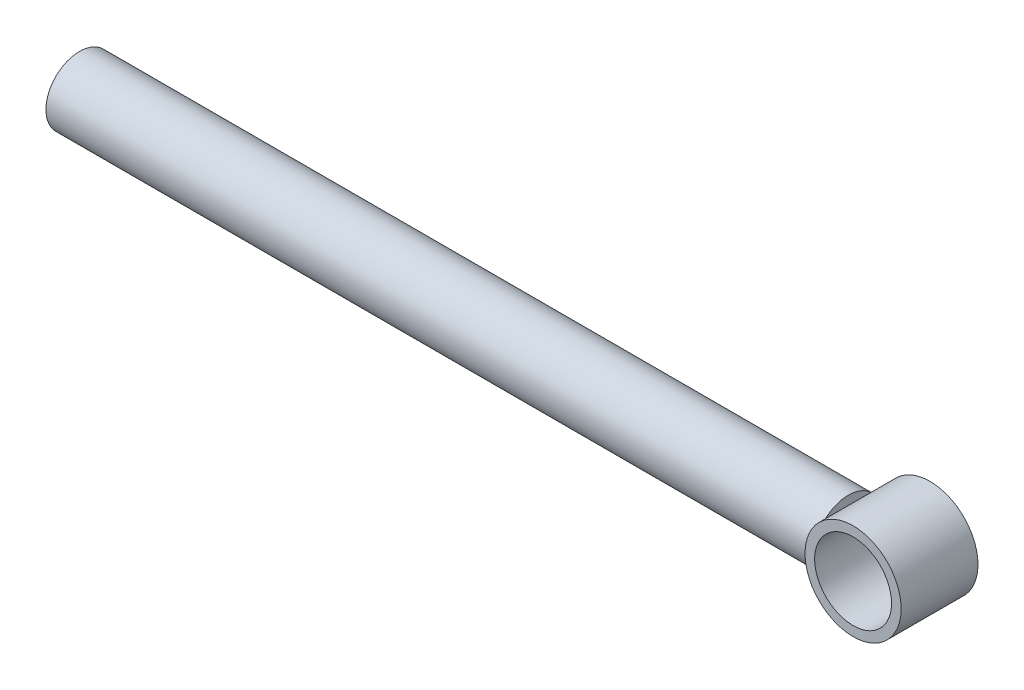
ISO-10303-21;
HEADER;
FILE_DESCRIPTION(('STEP AP214'),'2;1');
FILE_NAME('part.step','',(''),(''),'','','');
FILE_SCHEMA(('AUTOMOTIVE_DESIGN { 1 0 10303 214 1 1 1 1 }'));
ENDSEC;
DATA;
#1=APPLICATION_CONTEXT('core data for automotive mechanical design processes');
#2=APPLICATION_PROTOCOL_DEFINITION('international standard','automotive_design',2000,#1);
#3=PRODUCT_CONTEXT('',#1,'mechanical');
#4=PRODUCT('Part','Part','',(#3));
#5=PRODUCT_RELATED_PRODUCT_CATEGORY('part','',(#4));
#6=PRODUCT_DEFINITION_FORMATION('','',#4);
#7=PRODUCT_DEFINITION_CONTEXT('part definition',#1,'design');
#8=PRODUCT_DEFINITION('design','',#6,#7);
#9=PRODUCT_DEFINITION_SHAPE('','',#8);
#10=(LENGTH_UNIT() NAMED_UNIT(*) SI_UNIT(.MILLI.,.METRE.));
#11=(NAMED_UNIT(*) PLANE_ANGLE_UNIT() SI_UNIT($,.RADIAN.));
#12=(NAMED_UNIT(*) SI_UNIT($,.STERADIAN.) SOLID_ANGLE_UNIT());
#13=UNCERTAINTY_MEASURE_WITH_UNIT(LENGTH_MEASURE(1.E-05),#10,'distance_accuracy_value','');
#14=(GEOMETRIC_REPRESENTATION_CONTEXT(3) GLOBAL_UNCERTAINTY_ASSIGNED_CONTEXT((#13)) GLOBAL_UNIT_ASSIGNED_CONTEXT((#10,
#11,#12)) REPRESENTATION_CONTEXT('',''));
#15=CARTESIAN_POINT('',(0.,0.,0.));
#16=DIRECTION('',(0.,0.,1.));
#17=DIRECTION('',(1.,0.,0.));
#18=AXIS2_PLACEMENT_3D('',#15,#16,#17);
#19=CARTESIAN_POINT('',(0.,0.,50.8));
#20=DIRECTION('',(0.,0.,1.));
#21=DIRECTION('',(1.,0.,0.));
#22=AXIS2_PLACEMENT_3D('',#19,#20,#21);
#23=PLANE('',#22);
#24=CARTESIAN_POINT('',(0.,0.,50.8));
#25=DIRECTION('',(0.,0.,1.));
#26=DIRECTION('',(1.,0.,0.));
#27=AXIS2_PLACEMENT_3D('',#24,#25,#26);
#28=CIRCLE('',#27,63.5);
#29=CARTESIAN_POINT('',(63.5,0.,50.8));
#30=VERTEX_POINT('',#29);
#31=EDGE_CURVE('E381',#30,#30,#28,.T.);
#32=ORIENTED_EDGE('',*,*,#31,.T.);
#33=EDGE_LOOP('',(#32));
#34=FACE_BOUND('',#33,.T.);
#35=CARTESIAN_POINT('',(0.,0.,50.8));
#36=DIRECTION('',(0.,0.,1.));
#37=DIRECTION('',(1.,0.,0.));
#38=AXIS2_PLACEMENT_3D('',#35,#36,#37);
#39=CIRCLE('',#38,50.8);
#40=CARTESIAN_POINT('',(50.8,0.,50.8));
#41=VERTEX_POINT('',#40);
#42=EDGE_CURVE('E422',#41,#41,#39,.T.);
#43=ORIENTED_EDGE('',*,*,#42,.F.);
#44=EDGE_LOOP('',(#43));
#45=FACE_BOUND('',#44,.T.);
#46=ADVANCED_FACE('F348',(#34,#45),#23,.T.);
#47=CARTESIAN_POINT('',(0.,0.,50.8));
#48=DIRECTION('',(0.,0.,-1.));
#49=DIRECTION('',(-1.,0.,0.));
#50=AXIS2_PLACEMENT_3D('',#47,#48,#49);
#51=CYLINDRICAL_SURFACE('',#50,63.5);
#52=CARTESIAN_POINT('',(-57.15,27.6790082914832,34.7803824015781));
#53=CARTESIAN_POINT('',(-57.3608962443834,27.2435633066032,35.1269111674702));
#54=CARTESIAN_POINT('',(-57.5691546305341,26.8008738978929,35.4658636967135));
#55=CARTESIAN_POINT('',(-57.9795220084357,25.9011500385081,36.1281770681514));
#56=CARTESIAN_POINT('',(-58.1816304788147,25.4441143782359,36.4515365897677));
#57=CARTESIAN_POINT('',(-58.7776050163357,24.0512606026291,37.397858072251));
#58=CARTESIAN_POINT('',(-59.1608656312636,23.0942173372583,37.9966470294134));
#59=CARTESIAN_POINT('',(-59.8938910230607,21.1207683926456,39.1282198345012));
#60=CARTESIAN_POINT('',(-60.2434302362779,20.1040275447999,39.6605653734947));
#61=CARTESIAN_POINT('',(-60.8989795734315,18.0209845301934,40.649418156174));
#62=CARTESIAN_POINT('',(-61.2050000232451,16.9546942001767,41.1059433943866));
#63=CARTESIAN_POINT('',(-61.7682326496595,14.7720150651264,41.9399834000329));
#64=CARTESIAN_POINT('',(-62.0251710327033,13.6553858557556,42.3170560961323));
#65=CARTESIAN_POINT('',(-62.4818378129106,11.384677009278,42.9836194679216));
#66=CARTESIAN_POINT('',(-62.6815623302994,10.2305948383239,43.2731042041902));
#67=CARTESIAN_POINT('',(-63.0179242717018,7.89781057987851,43.7589067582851));
#68=CARTESIAN_POINT('',(-63.1547614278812,6.7191990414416,43.9555195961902));
#69=CARTESIAN_POINT('',(-63.3624283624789,4.34428538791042,44.2533762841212));
#70=CARTESIAN_POINT('',(-63.4332671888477,3.14798572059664,44.354633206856));
#71=CARTESIAN_POINT('',(-63.5030389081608,0.875702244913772,44.4543520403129));
#72=CARTESIAN_POINT('',(-63.5087686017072,-0.199661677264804,44.4625306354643));
#73=CARTESIAN_POINT('',(-63.4656951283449,-2.34701468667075,44.4009851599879));
#74=CARTESIAN_POINT('',(-63.416895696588,-3.41900400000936,44.3312664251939));
#75=CARTESIAN_POINT('',(-63.2658562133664,-5.55208119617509,44.114929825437));
#76=CARTESIAN_POINT('',(-63.163580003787,-6.61316120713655,43.9682599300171));
#77=CARTESIAN_POINT('',(-62.9078997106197,-8.71596148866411,43.6001590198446));
#78=CARTESIAN_POINT('',(-62.7544958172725,-9.75768183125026,43.3787282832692));
#79=CARTESIAN_POINT('',(-62.4062122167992,-11.7783000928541,42.873302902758));
#80=CARTESIAN_POINT('',(-62.2129990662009,-12.7581152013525,42.5918095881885));
#81=CARTESIAN_POINT('',(-61.785815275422,-14.6880874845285,41.965366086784));
#82=CARTESIAN_POINT('',(-61.5518436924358,-15.6382439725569,41.6204144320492));
#83=CARTESIAN_POINT('',(-61.0473051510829,-17.5046089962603,40.8705626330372));
#84=CARTESIAN_POINT('',(-60.7767336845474,-18.4208133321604,40.4656551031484));
#85=CARTESIAN_POINT('',(-60.2035377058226,-20.2156194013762,39.599543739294));
#86=CARTESIAN_POINT('',(-59.9009185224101,-21.0942273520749,39.1383492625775));
#87=CARTESIAN_POINT('',(-59.3978527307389,-22.4596823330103,38.362812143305));
#88=CARTESIAN_POINT('',(-59.2062854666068,-22.9596828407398,38.0656282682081));
#89=CARTESIAN_POINT('',(-58.8146170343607,-23.9451844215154,37.4535310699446));
#90=CARTESIAN_POINT('',(-58.6145172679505,-24.4306878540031,37.138620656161));
#91=CARTESIAN_POINT('',(-58.2073867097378,-25.3854014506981,36.4926719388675));
#92=CARTESIAN_POINT('',(-58.000379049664,-25.8546570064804,36.1616860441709));
#93=CARTESIAN_POINT('',(-57.5798335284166,-26.7781698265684,35.4832407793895));
#94=CARTESIAN_POINT('',(-57.3662950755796,-27.2324257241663,35.1357799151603));
#95=CARTESIAN_POINT('',(-57.15,-27.6790082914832,34.7803824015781));
#96=B_SPLINE_CURVE_WITH_KNOTS('',3,(#52,#53,#54,#55,#56,#57,#58,#59,#60,#61,#62,#63,#64,#65,#66,
#67,#68,#69,#70,#71,#72,#73,#74,#75,#76,#77,#78,#79,#80,#81,#82,#83,#84,#85,#86,#87,#88,#89,#90,
#91,#92,#93,#94,#95),.UNSPECIFIED.,.F.,.F.,(4,2,2,2,2,2,2,2,2,2,2,2,2,2,2,2,2,2,2,2,2,4),(0.,
1.78517101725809,3.57049295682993,7.14327365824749,10.7385002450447,14.3328723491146,
17.9467440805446,21.5608608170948,25.1634183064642,28.7654818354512,31.9875796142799,
35.209456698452,38.4335150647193,41.6575614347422,44.7671025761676,47.8767156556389,
50.9867121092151,54.0961922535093,55.9329226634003,57.7693524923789,59.6001517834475,
61.4311174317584),.UNSPECIFIED.);
#97=CARTESIAN_POINT('',(-57.15,27.6790082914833,34.780382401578));
#98=VERTEX_POINT('',#97);
#99=CARTESIAN_POINT('',(-57.15,-27.6790082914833,34.780382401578));
#100=VERTEX_POINT('',#99);
#101=EDGE_CURVE('E380',#98,#100,#96,.T.);
#102=ORIENTED_EDGE('',*,*,#101,.T.);
#103=DIRECTION('',(0.,0.,-1.));
#104=VECTOR('',#103,1.);
#105=CARTESIAN_POINT('',(-57.15,-27.6790082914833,50.8));
#106=LINE('',#105,#104);
#107=CARTESIAN_POINT('',(-57.15,-27.6790082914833,-34.780382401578));
#108=VERTEX_POINT('',#107);
#109=EDGE_CURVE('E11',#100,#108,#106,.T.);
#110=ORIENTED_EDGE('',*,*,#109,.T.);
#111=CARTESIAN_POINT('',(-57.15,-27.6790082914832,-34.7803824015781));
#112=CARTESIAN_POINT('',(-57.3608962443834,-27.2435633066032,-35.1269111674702));
#113=CARTESIAN_POINT('',(-57.5691546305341,-26.8008738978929,-35.4658636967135));
#114=CARTESIAN_POINT('',(-57.9795220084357,-25.9011500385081,-36.1281770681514));
#115=CARTESIAN_POINT('',(-58.1816304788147,-25.4441143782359,-36.4515365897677));
#116=CARTESIAN_POINT('',(-58.7776050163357,-24.0512606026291,-37.397858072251));
#117=CARTESIAN_POINT('',(-59.1608656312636,-23.0942173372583,-37.9966470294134));
#118=CARTESIAN_POINT('',(-59.8938910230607,-21.1207683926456,-39.1282198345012));
#119=CARTESIAN_POINT('',(-60.2434302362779,-20.1040275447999,-39.6605653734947));
#120=CARTESIAN_POINT('',(-60.8989795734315,-18.0209845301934,-40.649418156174));
#121=CARTESIAN_POINT('',(-61.2050000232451,-16.9546942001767,-41.1059433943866));
#122=CARTESIAN_POINT('',(-61.7682326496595,-14.7720150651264,-41.9399834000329));
#123=CARTESIAN_POINT('',(-62.0251710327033,-13.6553858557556,-42.3170560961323));
#124=CARTESIAN_POINT('',(-62.4818378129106,-11.384677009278,-42.9836194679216));
#125=CARTESIAN_POINT('',(-62.6815623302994,-10.2305948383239,-43.2731042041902));
#126=CARTESIAN_POINT('',(-63.0179242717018,-7.89781057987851,-43.7589067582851));
#127=CARTESIAN_POINT('',(-63.1547614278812,-6.7191990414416,-43.9555195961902));
#128=CARTESIAN_POINT('',(-63.3624283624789,-4.34428538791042,-44.2533762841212));
#129=CARTESIAN_POINT('',(-63.4332671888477,-3.14798572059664,-44.354633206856));
#130=CARTESIAN_POINT('',(-63.5030389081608,-0.875702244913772,-44.4543520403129));
#131=CARTESIAN_POINT('',(-63.5087686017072,0.199661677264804,-44.4625306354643));
#132=CARTESIAN_POINT('',(-63.4656951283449,2.34701468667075,-44.4009851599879));
#133=CARTESIAN_POINT('',(-63.416895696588,3.41900400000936,-44.3312664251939));
#134=CARTESIAN_POINT('',(-63.2658562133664,5.55208119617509,-44.114929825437));
#135=CARTESIAN_POINT('',(-63.163580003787,6.61316120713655,-43.9682599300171));
#136=CARTESIAN_POINT('',(-62.9078997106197,8.71596148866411,-43.6001590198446));
#137=CARTESIAN_POINT('',(-62.7544958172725,9.75768183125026,-43.3787282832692));
#138=CARTESIAN_POINT('',(-62.4062122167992,11.7783000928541,-42.873302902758));
#139=CARTESIAN_POINT('',(-62.2129990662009,12.7581152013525,-42.5918095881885));
#140=CARTESIAN_POINT('',(-61.785815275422,14.6880874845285,-41.965366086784));
#141=CARTESIAN_POINT('',(-61.5518436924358,15.6382439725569,-41.6204144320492));
#142=CARTESIAN_POINT('',(-61.0473051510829,17.5046089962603,-40.8705626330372));
#143=CARTESIAN_POINT('',(-60.7767336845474,18.4208133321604,-40.4656551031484));
#144=CARTESIAN_POINT('',(-60.2035377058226,20.2156194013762,-39.599543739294));
#145=CARTESIAN_POINT('',(-59.9009185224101,21.0942273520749,-39.1383492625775));
#146=CARTESIAN_POINT('',(-59.3978527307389,22.4596823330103,-38.362812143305));
#147=CARTESIAN_POINT('',(-59.2062854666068,22.9596828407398,-38.0656282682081));
#148=CARTESIAN_POINT('',(-58.8146170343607,23.9451844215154,-37.4535310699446));
#149=CARTESIAN_POINT('',(-58.6145172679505,24.4306878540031,-37.138620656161));
#150=CARTESIAN_POINT('',(-58.2073867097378,25.3854014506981,-36.4926719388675));
#151=CARTESIAN_POINT('',(-58.000379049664,25.8546570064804,-36.1616860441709));
#152=CARTESIAN_POINT('',(-57.5798335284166,26.7781698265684,-35.4832407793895));
#153=CARTESIAN_POINT('',(-57.3662950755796,27.2324257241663,-35.1357799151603));
#154=CARTESIAN_POINT('',(-57.15,27.6790082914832,-34.7803824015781));
#155=B_SPLINE_CURVE_WITH_KNOTS('',3,(#111,#112,#113,#114,#115,#116,#117,#118,#119,#120,#121,
#122,#123,#124,#125,#126,#127,#128,#129,#130,#131,#132,#133,#134,#135,#136,#137,#138,#139,#140,
#141,#142,#143,#144,#145,#146,#147,#148,#149,#150,#151,#152,#153,#154),.UNSPECIFIED.,.F.,.F.,(4,
2,2,2,2,2,2,2,2,2,2,2,2,2,2,2,2,2,2,2,2,4),(0.,1.78517101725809,3.57049295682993,
7.14327365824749,10.7385002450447,14.3328723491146,17.9467440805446,21.5608608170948,
25.1634183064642,28.7654818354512,31.9875796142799,35.209456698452,38.4335150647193,
41.6575614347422,44.7671025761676,47.8767156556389,50.9867121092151,54.0961922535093,
55.9329226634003,57.7693524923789,59.6001517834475,61.4311174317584),.UNSPECIFIED.);
#156=CARTESIAN_POINT('',(-57.15,27.6790082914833,-34.780382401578));
#157=VERTEX_POINT('',#156);
#158=EDGE_CURVE('E357',#108,#157,#155,.T.);
#159=ORIENTED_EDGE('',*,*,#158,.T.);
#160=DIRECTION('',(0.,0.,-1.));
#161=VECTOR('',#160,1.);
#162=CARTESIAN_POINT('',(-57.15,27.6790082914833,50.8));
#163=LINE('',#162,#161);
#164=EDGE_CURVE('E376',#157,#98,#163,.F.);
#165=ORIENTED_EDGE('',*,*,#164,.T.);
#166=EDGE_LOOP('',(#102,#110,#159,#165));
#167=FACE_BOUND('',#166,.T.);
#168=ORIENTED_EDGE('',*,*,#31,.F.);
#169=EDGE_LOOP('',(#168));
#170=FACE_BOUND('',#169,.T.);
#171=CARTESIAN_POINT('',(0.,0.,-50.8));
#172=DIRECTION('',(0.,0.,1.));
#173=DIRECTION('',(1.,0.,0.));
#174=AXIS2_PLACEMENT_3D('',#171,#172,#173);
#175=CIRCLE('',#174,63.5);
#176=CARTESIAN_POINT('',(63.5,0.,-50.8));
#177=VERTEX_POINT('',#176);
#178=EDGE_CURVE('E423',#177,#177,#175,.T.);
#179=ORIENTED_EDGE('',*,*,#178,.T.);
#180=EDGE_LOOP('',(#179));
#181=FACE_BOUND('',#180,.T.);
#182=ADVANCED_FACE('F350',(#167,#170,#181),#51,.T.);
#183=CARTESIAN_POINT('',(0.,0.,50.8));
#184=DIRECTION('',(0.,0.,-1.));
#185=DIRECTION('',(-1.,0.,0.));
#186=AXIS2_PLACEMENT_3D('',#183,#184,#185);
#187=CYLINDRICAL_SURFACE('',#186,50.8);
#188=ORIENTED_EDGE('',*,*,#42,.T.);
#189=EDGE_LOOP('',(#188));
#190=FACE_BOUND('',#189,.T.);
#191=CARTESIAN_POINT('',(0.,0.,-50.8));
#192=DIRECTION('',(0.,0.,1.));
#193=DIRECTION('',(1.,0.,0.));
#194=AXIS2_PLACEMENT_3D('',#191,#192,#193);
#195=CIRCLE('',#194,50.8);
#196=CARTESIAN_POINT('',(50.8,0.,-50.8));
#197=VERTEX_POINT('',#196);
#198=EDGE_CURVE('E427',#197,#197,#195,.T.);
#199=ORIENTED_EDGE('',*,*,#198,.F.);
#200=EDGE_LOOP('',(#199));
#201=FACE_BOUND('',#200,.T.);
#202=ADVANCED_FACE('F408',(#190,#201),#187,.F.);
#203=CARTESIAN_POINT('',(0.,0.,-50.8));
#204=DIRECTION('',(0.,0.,1.));
#205=DIRECTION('',(1.,0.,0.));
#206=AXIS2_PLACEMENT_3D('',#203,#204,#205);
#207=PLANE('',#206);
#208=ORIENTED_EDGE('',*,*,#198,.T.);
#209=EDGE_LOOP('',(#208));
#210=FACE_BOUND('',#209,.T.);
#211=ORIENTED_EDGE('',*,*,#178,.F.);
#212=EDGE_LOOP('',(#211));
#213=FACE_BOUND('',#212,.T.);
#214=ADVANCED_FACE('F401',(#210,#213),#207,.F.);
#215=CARTESIAN_POINT('',(-1073.15,0.,0.));
#216=DIRECTION('',(1.,0.,0.));
#217=DIRECTION('',(0.,0.,-1.));
#218=AXIS2_PLACEMENT_3D('',#215,#216,#217);
#219=CYLINDRICAL_SURFACE('',#218,44.45);
#220=CARTESIAN_POINT('',(-1073.15,0.,0.));
#221=DIRECTION('',(1.,0.,0.));
#222=DIRECTION('',(0.,0.,-1.));
#223=AXIS2_PLACEMENT_3D('',#220,#221,#222);
#224=CIRCLE('',#223,44.45);
#225=CARTESIAN_POINT('',(-1073.15,0.,-44.45));
#226=VERTEX_POINT('',#225);
#227=EDGE_CURVE('E384',#226,#226,#224,.T.);
#228=ORIENTED_EDGE('',*,*,#227,.T.);
#229=EDGE_LOOP('',(#228));
#230=FACE_BOUND('',#229,.T.);
#231=ORIENTED_EDGE('',*,*,#158,.F.);
#232=CARTESIAN_POINT('',(-57.15,0.,0.));
#233=DIRECTION('',(1.,0.,0.));
#234=DIRECTION('',(0.,0.,-1.));
#235=AXIS2_PLACEMENT_3D('',#232,#233,#234);
#236=CIRCLE('',#235,44.45);
#237=EDGE_CURVE('E385',#100,#108,#236,.T.);
#238=ORIENTED_EDGE('',*,*,#237,.F.);
#239=ORIENTED_EDGE('',*,*,#101,.F.);
#240=EDGE_CURVE('E363',#157,#98,#236,.T.);
#241=ORIENTED_EDGE('',*,*,#240,.F.);
#242=EDGE_LOOP('',(#231,#238,#239,#241));
#243=FACE_BOUND('',#242,.T.);
#244=ADVANCED_FACE('F383',(#230,#243),#219,.T.);
#245=CARTESIAN_POINT('',(-57.15,0.,0.));
#246=DIRECTION('',(1.,0.,0.));
#247=DIRECTION('',(0.,0.,-1.));
#248=AXIS2_PLACEMENT_3D('',#245,#246,#247);
#249=PLANE('',#248);
#250=ORIENTED_EDGE('',*,*,#109,.F.);
#251=ORIENTED_EDGE('',*,*,#237,.T.);
#252=EDGE_LOOP('',(#250,#251));
#253=FACE_BOUND('',#252,.T.);
#254=ADVANCED_FACE('F400',(#253),#249,.T.);
#255=ORIENTED_EDGE('',*,*,#164,.F.);
#256=ORIENTED_EDGE('',*,*,#240,.T.);
#257=EDGE_LOOP('',(#255,#256));
#258=FACE_BOUND('',#257,.T.);
#259=ADVANCED_FACE('F377',(#258),#249,.T.);
#260=CARTESIAN_POINT('',(-1073.15,0.,0.));
#261=DIRECTION('',(1.,0.,0.));
#262=DIRECTION('',(0.,0.,-1.));
#263=AXIS2_PLACEMENT_3D('',#260,#261,#262);
#264=PLANE('',#263);
#265=ORIENTED_EDGE('',*,*,#227,.F.);
#266=EDGE_LOOP('',(#265));
#267=FACE_BOUND('',#266,.T.);
#268=ADVANCED_FACE('F403',(#267),#264,.F.);
#269=CLOSED_SHELL('',(#46,#182,#202,#214,#244,#254,#259,#268));
#270=MANIFOLD_SOLID_BREP('B2',#269);
#271=ADVANCED_BREP_SHAPE_REPRESENTATION('',(#18,#270),#14);
#272=SHAPE_DEFINITION_REPRESENTATION(#9,#271);
ENDSEC;
END-ISO-10303-21;
